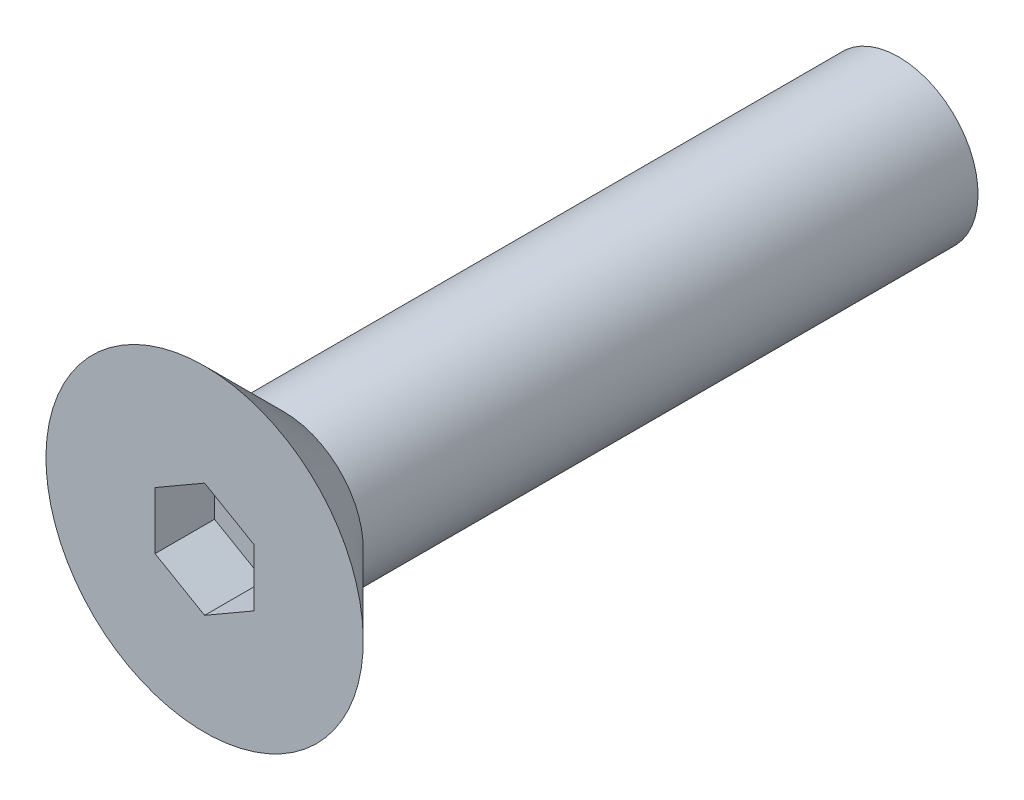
ISO-10303-21;
HEADER;
FILE_DESCRIPTION(('STEP AP214'),'2;1');
FILE_NAME('part.step','',(''),(''),'','','');
FILE_SCHEMA(('AUTOMOTIVE_DESIGN { 1 0 10303 214 1 1 1 1 }'));
ENDSEC;
DATA;
#1=APPLICATION_CONTEXT('core data for automotive mechanical design processes');
#2=APPLICATION_PROTOCOL_DEFINITION('international standard','automotive_design',2000,#1);
#3=PRODUCT_CONTEXT('',#1,'mechanical');
#4=PRODUCT('Part','Part','',(#3));
#5=PRODUCT_RELATED_PRODUCT_CATEGORY('part','',(#4));
#6=PRODUCT_DEFINITION_FORMATION('','',#4);
#7=PRODUCT_DEFINITION_CONTEXT('part definition',#1,'design');
#8=PRODUCT_DEFINITION('design','',#6,#7);
#9=PRODUCT_DEFINITION_SHAPE('','',#8);
#10=(LENGTH_UNIT() NAMED_UNIT(*) SI_UNIT(.MILLI.,.METRE.));
#11=(NAMED_UNIT(*) PLANE_ANGLE_UNIT() SI_UNIT($,.RADIAN.));
#12=(NAMED_UNIT(*) SI_UNIT($,.STERADIAN.) SOLID_ANGLE_UNIT());
#13=UNCERTAINTY_MEASURE_WITH_UNIT(LENGTH_MEASURE(1.E-05),#10,'distance_accuracy_value','');
#14=(GEOMETRIC_REPRESENTATION_CONTEXT(3) GLOBAL_UNCERTAINTY_ASSIGNED_CONTEXT((#13)) GLOBAL_UNIT_ASSIGNED_CONTEXT((#10,
#11,#12)) REPRESENTATION_CONTEXT('',''));
#15=CARTESIAN_POINT('',(0.,0.,0.));
#16=DIRECTION('',(0.,0.,1.));
#17=DIRECTION('',(1.,0.,0.));
#18=AXIS2_PLACEMENT_3D('',#15,#16,#17);
#19=CARTESIAN_POINT('',(0.,0.,0.));
#20=DIRECTION('',(0.,0.,-1.));
#21=DIRECTION('',(0.,1.,0.));
#22=AXIS2_PLACEMENT_3D('',#19,#20,#21);
#23=PLANE('',#22);
#24=DIRECTION('',(-0.866025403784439,-0.5,0.));
#25=VECTOR('',#24,1.);
#26=CARTESIAN_POINT('',(0.,2.88675134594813,0.));
#27=LINE('',#26,#25);
#28=CARTESIAN_POINT('',(0.,2.88675134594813,0.));
#29=VERTEX_POINT('',#28);
#30=CARTESIAN_POINT('',(-2.5,1.44337567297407,0.));
#31=VERTEX_POINT('',#30);
#32=EDGE_CURVE('E102',#29,#31,#27,.T.);
#33=ORIENTED_EDGE('',*,*,#32,.F.);
#34=DIRECTION('',(-0.866025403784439,0.5,0.));
#35=VECTOR('',#34,1.);
#36=CARTESIAN_POINT('',(2.5,1.44337567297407,0.));
#37=LINE('',#36,#35);
#38=CARTESIAN_POINT('',(2.5,1.44337567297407,0.));
#39=VERTEX_POINT('',#38);
#40=EDGE_CURVE('E28',#39,#29,#37,.T.);
#41=ORIENTED_EDGE('',*,*,#40,.F.);
#42=DIRECTION('',(0.,1.,0.));
#43=VECTOR('',#42,1.);
#44=CARTESIAN_POINT('',(2.5,-1.44337567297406,0.));
#45=LINE('',#44,#43);
#46=CARTESIAN_POINT('',(2.5,-1.44337567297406,0.));
#47=VERTEX_POINT('',#46);
#48=EDGE_CURVE('E111',#47,#39,#45,.T.);
#49=ORIENTED_EDGE('',*,*,#48,.F.);
#50=DIRECTION('',(0.866025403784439,0.5,0.));
#51=VECTOR('',#50,1.);
#52=CARTESIAN_POINT('',(0.,-2.88675134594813,0.));
#53=LINE('',#52,#51);
#54=CARTESIAN_POINT('',(0.,-2.88675134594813,0.));
#55=VERTEX_POINT('',#54);
#56=EDGE_CURVE('E109',#55,#47,#53,.T.);
#57=ORIENTED_EDGE('',*,*,#56,.F.);
#58=DIRECTION('',(0.866025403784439,-0.5,0.));
#59=VECTOR('',#58,1.);
#60=CARTESIAN_POINT('',(-2.5,-1.44337567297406,0.));
#61=LINE('',#60,#59);
#62=CARTESIAN_POINT('',(-2.5,-1.44337567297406,0.));
#63=VERTEX_POINT('',#62);
#64=EDGE_CURVE('E76',#63,#55,#61,.T.);
#65=ORIENTED_EDGE('',*,*,#64,.F.);
#66=DIRECTION('',(0.,-1.,0.));
#67=VECTOR('',#66,1.);
#68=CARTESIAN_POINT('',(-2.5,1.44337567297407,0.));
#69=LINE('',#68,#67);
#70=EDGE_CURVE('E105',#31,#63,#69,.T.);
#71=ORIENTED_EDGE('',*,*,#70,.F.);
#72=EDGE_LOOP('',(#33,#41,#49,#57,#65,#71));
#73=FACE_BOUND('',#72,.T.);
#74=CARTESIAN_POINT('',(0.,0.,0.));
#75=DIRECTION('',(0.,0.,-1.));
#76=DIRECTION('',(0.,1.,0.));
#77=AXIS2_PLACEMENT_3D('',#74,#75,#76);
#78=CIRCLE('',#77,8.);
#79=CARTESIAN_POINT('',(0.,8.,0.));
#80=VERTEX_POINT('',#79);
#81=EDGE_CURVE('E9',#80,#80,#78,.T.);
#82=ORIENTED_EDGE('',*,*,#81,.F.);
#83=EDGE_LOOP('',(#82));
#84=FACE_BOUND('',#83,.T.);
#85=ADVANCED_FACE('F14',(#73,#84),#23,.F.);
#86=CARTESIAN_POINT('',(0.,0.,0.));
#87=DIRECTION('',(0.,0.,1.));
#88=DIRECTION('',(0.,-1.,0.));
#89=AXIS2_PLACEMENT_3D('',#86,#87,#88);
#90=CONICAL_SURFACE('',#89,8.,0.785398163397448);
#91=CARTESIAN_POINT('',(0.,0.,-4.));
#92=DIRECTION('',(0.,0.,-1.));
#93=DIRECTION('',(0.,1.,0.));
#94=AXIS2_PLACEMENT_3D('',#91,#92,#93);
#95=CIRCLE('',#94,4.);
#96=CARTESIAN_POINT('',(0.,4.,-4.));
#97=VERTEX_POINT('',#96);
#98=EDGE_CURVE('E21',#97,#97,#95,.T.);
#99=ORIENTED_EDGE('',*,*,#98,.F.);
#100=EDGE_LOOP('',(#99));
#101=FACE_BOUND('',#100,.T.);
#102=ORIENTED_EDGE('',*,*,#81,.T.);
#103=EDGE_LOOP('',(#102));
#104=FACE_BOUND('',#103,.T.);
#105=ADVANCED_FACE('F127',(#101,#104),#90,.T.);
#106=CARTESIAN_POINT('',(0.,0.,-10.0277639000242));
#107=DIRECTION('',(0.,0.,-1.));
#108=DIRECTION('',(0.,1.,0.));
#109=AXIS2_PLACEMENT_3D('',#106,#107,#108);
#110=CYLINDRICAL_SURFACE('',#109,4.);
#111=CARTESIAN_POINT('',(0.,0.,-35.));
#112=DIRECTION('',(0.,0.,-1.));
#113=DIRECTION('',(0.,1.,0.));
#114=AXIS2_PLACEMENT_3D('',#111,#112,#113);
#115=CIRCLE('',#114,4.);
#116=CARTESIAN_POINT('',(0.,3.99999999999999,-35.));
#117=VERTEX_POINT('',#116);
#118=EDGE_CURVE('E115',#117,#117,#115,.T.);
#119=ORIENTED_EDGE('',*,*,#118,.F.);
#120=EDGE_LOOP('',(#119));
#121=FACE_BOUND('',#120,.T.);
#122=ORIENTED_EDGE('',*,*,#98,.T.);
#123=EDGE_LOOP('',(#122));
#124=FACE_BOUND('',#123,.T.);
#125=ADVANCED_FACE('F125',(#121,#124),#110,.T.);
#126=CARTESIAN_POINT('',(0.,4.,-35.));
#127=DIRECTION('',(0.,0.,1.));
#128=DIRECTION('',(0.,-1.,0.));
#129=AXIS2_PLACEMENT_3D('',#126,#127,#128);
#130=PLANE('',#129);
#131=ORIENTED_EDGE('',*,*,#118,.T.);
#132=EDGE_LOOP('',(#131));
#133=FACE_BOUND('',#132,.T.);
#134=ADVANCED_FACE('F147',(#133),#130,.F.);
#135=CARTESIAN_POINT('',(2.5,1.44337567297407,-3.));
#136=DIRECTION('',(0.5,0.866025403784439,0.));
#137=DIRECTION('',(-0.866025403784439,0.5,0.));
#138=AXIS2_PLACEMENT_3D('',#135,#136,#137);
#139=PLANE('',#138);
#140=ORIENTED_EDGE('',*,*,#40,.T.);
#141=DIRECTION('',(0.,0.,1.));
#142=VECTOR('',#141,1.);
#143=CARTESIAN_POINT('',(0.,2.88675134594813,-3.));
#144=LINE('',#143,#142);
#145=CARTESIAN_POINT('',(0.,2.88675134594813,-3.));
#146=VERTEX_POINT('',#145);
#147=EDGE_CURVE('E58',#146,#29,#144,.T.);
#148=ORIENTED_EDGE('',*,*,#147,.F.);
#149=DIRECTION('',(-0.866025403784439,0.5,0.));
#150=VECTOR('',#149,1.);
#151=CARTESIAN_POINT('',(2.5,1.44337567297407,-3.));
#152=LINE('',#151,#150);
#153=CARTESIAN_POINT('',(2.5,1.44337567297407,-3.));
#154=VERTEX_POINT('',#153);
#155=EDGE_CURVE('E113',#154,#146,#152,.T.);
#156=ORIENTED_EDGE('',*,*,#155,.F.);
#157=DIRECTION('',(0.,0.,1.));
#158=VECTOR('',#157,1.);
#159=CARTESIAN_POINT('',(2.5,1.44337567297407,-3.));
#160=LINE('',#159,#158);
#161=EDGE_CURVE('E36',#154,#39,#160,.T.);
#162=ORIENTED_EDGE('',*,*,#161,.T.);
#163=EDGE_LOOP('',(#140,#148,#156,#162));
#164=FACE_BOUND('',#163,.T.);
#165=ADVANCED_FACE('F144',(#164),#139,.F.);
#166=CARTESIAN_POINT('',(2.5,-1.44337567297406,-3.));
#167=DIRECTION('',(1.,0.,0.));
#168=DIRECTION('',(0.,0.,-1.));
#169=AXIS2_PLACEMENT_3D('',#166,#167,#168);
#170=PLANE('',#169);
#171=ORIENTED_EDGE('',*,*,#48,.T.);
#172=ORIENTED_EDGE('',*,*,#161,.F.);
#173=DIRECTION('',(0.,1.,0.));
#174=VECTOR('',#173,1.);
#175=CARTESIAN_POINT('',(2.5,-1.44337567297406,-3.));
#176=LINE('',#175,#174);
#177=CARTESIAN_POINT('',(2.5,-1.44337567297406,-3.));
#178=VERTEX_POINT('',#177);
#179=EDGE_CURVE('E88',#178,#154,#176,.T.);
#180=ORIENTED_EDGE('',*,*,#179,.F.);
#181=DIRECTION('',(0.,0.,1.));
#182=VECTOR('',#181,1.);
#183=CARTESIAN_POINT('',(2.5,-1.44337567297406,-3.));
#184=LINE('',#183,#182);
#185=EDGE_CURVE('E80',#178,#47,#184,.T.);
#186=ORIENTED_EDGE('',*,*,#185,.T.);
#187=EDGE_LOOP('',(#171,#172,#180,#186));
#188=FACE_BOUND('',#187,.T.);
#189=ADVANCED_FACE('F146',(#188),#170,.F.);
#190=CARTESIAN_POINT('',(0.,-2.88675134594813,-3.));
#191=DIRECTION('',(0.5,-0.866025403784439,0.));
#192=DIRECTION('',(0.866025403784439,0.5,0.));
#193=AXIS2_PLACEMENT_3D('',#190,#191,#192);
#194=PLANE('',#193);
#195=ORIENTED_EDGE('',*,*,#56,.T.);
#196=ORIENTED_EDGE('',*,*,#185,.F.);
#197=DIRECTION('',(0.866025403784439,0.5,0.));
#198=VECTOR('',#197,1.);
#199=CARTESIAN_POINT('',(0.,-2.88675134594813,-3.));
#200=LINE('',#199,#198);
#201=CARTESIAN_POINT('',(0.,-2.88675134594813,-3.));
#202=VERTEX_POINT('',#201);
#203=EDGE_CURVE('E84',#202,#178,#200,.T.);
#204=ORIENTED_EDGE('',*,*,#203,.F.);
#205=DIRECTION('',(0.,0.,1.));
#206=VECTOR('',#205,1.);
#207=CARTESIAN_POINT('',(0.,-2.88675134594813,-3.));
#208=LINE('',#207,#206);
#209=EDGE_CURVE('E69',#202,#55,#208,.T.);
#210=ORIENTED_EDGE('',*,*,#209,.T.);
#211=EDGE_LOOP('',(#195,#196,#204,#210));
#212=FACE_BOUND('',#211,.T.);
#213=ADVANCED_FACE('F85',(#212),#194,.F.);
#214=CARTESIAN_POINT('',(-2.5,-1.44337567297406,-3.));
#215=DIRECTION('',(-0.5,-0.866025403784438,0.));
#216=DIRECTION('',(0.866025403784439,-0.5,0.));
#217=AXIS2_PLACEMENT_3D('',#214,#215,#216);
#218=PLANE('',#217);
#219=ORIENTED_EDGE('',*,*,#64,.T.);
#220=ORIENTED_EDGE('',*,*,#209,.F.);
#221=DIRECTION('',(0.866025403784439,-0.5,0.));
#222=VECTOR('',#221,1.);
#223=CARTESIAN_POINT('',(-2.5,-1.44337567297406,-3.));
#224=LINE('',#223,#222);
#225=CARTESIAN_POINT('',(-2.5,-1.44337567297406,-3.));
#226=VERTEX_POINT('',#225);
#227=EDGE_CURVE('E73',#226,#202,#224,.T.);
#228=ORIENTED_EDGE('',*,*,#227,.F.);
#229=DIRECTION('',(0.,0.,1.));
#230=VECTOR('',#229,1.);
#231=CARTESIAN_POINT('',(-2.5,-1.44337567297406,-3.));
#232=LINE('',#231,#230);
#233=EDGE_CURVE('E81',#226,#63,#232,.T.);
#234=ORIENTED_EDGE('',*,*,#233,.T.);
#235=EDGE_LOOP('',(#219,#220,#228,#234));
#236=FACE_BOUND('',#235,.T.);
#237=ADVANCED_FACE('F71',(#236),#218,.F.);
#238=CARTESIAN_POINT('',(-2.5,1.44337567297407,-3.));
#239=DIRECTION('',(-1.,0.,0.));
#240=DIRECTION('',(0.,-1.,0.));
#241=AXIS2_PLACEMENT_3D('',#238,#239,#240);
#242=PLANE('',#241);
#243=ORIENTED_EDGE('',*,*,#70,.T.);
#244=ORIENTED_EDGE('',*,*,#233,.F.);
#245=DIRECTION('',(0.,-1.,0.));
#246=VECTOR('',#245,1.);
#247=CARTESIAN_POINT('',(-2.5,1.44337567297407,-3.));
#248=LINE('',#247,#246);
#249=CARTESIAN_POINT('',(-2.5,1.44337567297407,-3.));
#250=VERTEX_POINT('',#249);
#251=EDGE_CURVE('E94',#250,#226,#248,.T.);
#252=ORIENTED_EDGE('',*,*,#251,.F.);
#253=DIRECTION('',(0.,0.,1.));
#254=VECTOR('',#253,1.);
#255=CARTESIAN_POINT('',(-2.5,1.44337567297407,-3.));
#256=LINE('',#255,#254);
#257=EDGE_CURVE('E118',#250,#31,#256,.T.);
#258=ORIENTED_EDGE('',*,*,#257,.T.);
#259=EDGE_LOOP('',(#243,#244,#252,#258));
#260=FACE_BOUND('',#259,.T.);
#261=ADVANCED_FACE('F212',(#260),#242,.F.);
#262=CARTESIAN_POINT('',(0.,2.88675134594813,-3.));
#263=DIRECTION('',(-0.5,0.866025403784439,0.));
#264=DIRECTION('',(-0.866025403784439,-0.5,0.));
#265=AXIS2_PLACEMENT_3D('',#262,#263,#264);
#266=PLANE('',#265);
#267=ORIENTED_EDGE('',*,*,#32,.T.);
#268=ORIENTED_EDGE('',*,*,#257,.F.);
#269=DIRECTION('',(-0.866025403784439,-0.5,0.));
#270=VECTOR('',#269,1.);
#271=CARTESIAN_POINT('',(0.,2.88675134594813,-3.));
#272=LINE('',#271,#270);
#273=EDGE_CURVE('E96',#146,#250,#272,.T.);
#274=ORIENTED_EDGE('',*,*,#273,.F.);
#275=ORIENTED_EDGE('',*,*,#147,.T.);
#276=EDGE_LOOP('',(#267,#268,#274,#275));
#277=FACE_BOUND('',#276,.T.);
#278=ADVANCED_FACE('F142',(#277),#266,.F.);
#279=CARTESIAN_POINT('',(0.,0.,-3.));
#280=DIRECTION('',(0.,0.,1.));
#281=DIRECTION('',(1.,0.,0.));
#282=AXIS2_PLACEMENT_3D('',#279,#280,#281);
#283=PLANE('',#282);
#284=ORIENTED_EDGE('',*,*,#155,.T.);
#285=ORIENTED_EDGE('',*,*,#273,.T.);
#286=ORIENTED_EDGE('',*,*,#251,.T.);
#287=ORIENTED_EDGE('',*,*,#227,.T.);
#288=ORIENTED_EDGE('',*,*,#203,.T.);
#289=ORIENTED_EDGE('',*,*,#179,.T.);
#290=EDGE_LOOP('',(#284,#285,#286,#287,#288,#289));
#291=FACE_BOUND('',#290,.T.);
#292=ADVANCED_FACE('F91',(#291),#283,.T.);
#293=CLOSED_SHELL('',(#85,#105,#125,#134,#165,#189,#213,#237,#261,#278,#292));
#294=MANIFOLD_SOLID_BREP('B1',#293);
#295=ADVANCED_BREP_SHAPE_REPRESENTATION('',(#18,#294),#14);
#296=SHAPE_DEFINITION_REPRESENTATION(#9,#295);
ENDSEC;
END-ISO-10303-21;
